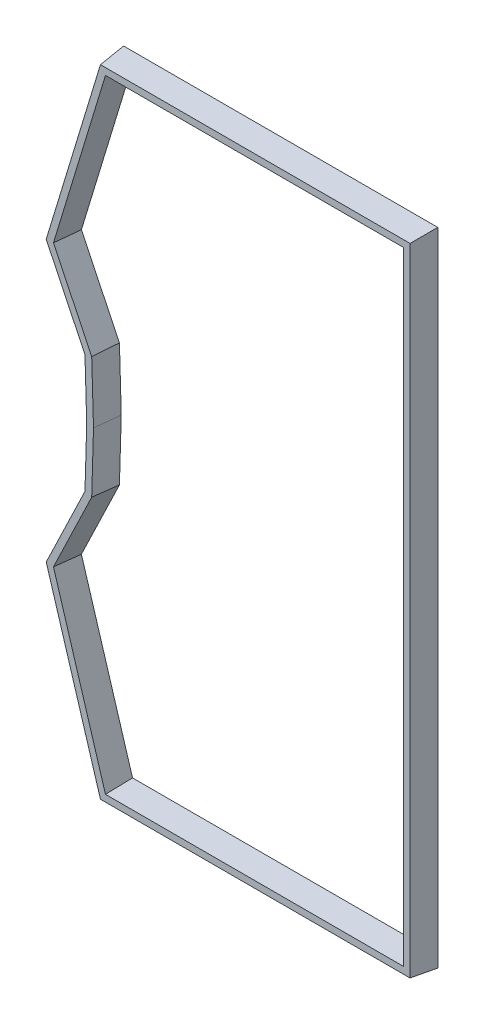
from build123d import *

# Parameters (mm, degrees)
BOSS_EXTRUDE1_DEPTH = 2.5
BOSS_EXTRUDE1_DRAFT = 6


with BuildPart() as part:
    # Sketch1 → Boss-Extrude1 (with draft: the straight prism first)
    with BuildSketch(Plane.XY):
        Polygon((13.262504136, 40.631854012), (13.435631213, 34.800566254), (13.262504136, 28.969278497), (9.384714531, 20.90793024), (14.869712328, 2.870205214), (46.149078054, 2.870205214), (46.149078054, 66.730927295), (14.869712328, 66.730927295), (9.384714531, 48.693202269), align=None)
        Polygon((14.454409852, 28.678836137), (10.668932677, 20.809391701), (15.759064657, 4.070205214), (44.949078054, 4.070205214), (44.949078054, 65.530927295), (15.759064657, 65.530927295), (10.668932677, 48.791740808), (14.454409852, 40.922296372), (14.636159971, 34.800566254), align=None, mode=Mode.SUBTRACT)
    extrude(amount=BOSS_EXTRUDE1_DEPTH)
    # Boss-Extrude1: the draft: its side faces are tilted about the plane it starts from
    boss_extrude1_sides = [part.faces().sort_by_distance(p)[0] for p in [
        (13.349067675, 37.716210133, 1.25),
        (13.349067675, 31.884922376, 1.25),
        (11.323609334, 24.938604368, 1.25),
        (12.12721343, 11.889067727, 1.25),
        (30.509395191, 2.870205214, 1.25),
        (46.149078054, 34.800566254, 1.25),
        (30.509395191, 66.730927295, 1.25),
        (12.12721343, 57.712064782, 1.25),
        (11.323609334, 44.662528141, 1.25),
        (14.545284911, 31.739701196, 1.25),
        (14.545284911, 37.861431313, 1.25),
        (12.561671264, 44.85701859, 1.25),
        (13.213998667, 57.161334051, 1.25),
        (30.354071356, 65.530927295, 1.25),
        (44.949078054, 34.800566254, 1.25),
        (30.354071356, 4.070205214, 1.25),
        (13.213998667, 12.439798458, 1.25),
        (12.561671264, 24.744113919, 1.25),
    ]]
    draft(boss_extrude1_sides, Plane.XY, BOSS_EXTRUDE1_DRAFT)


solid = part.part
